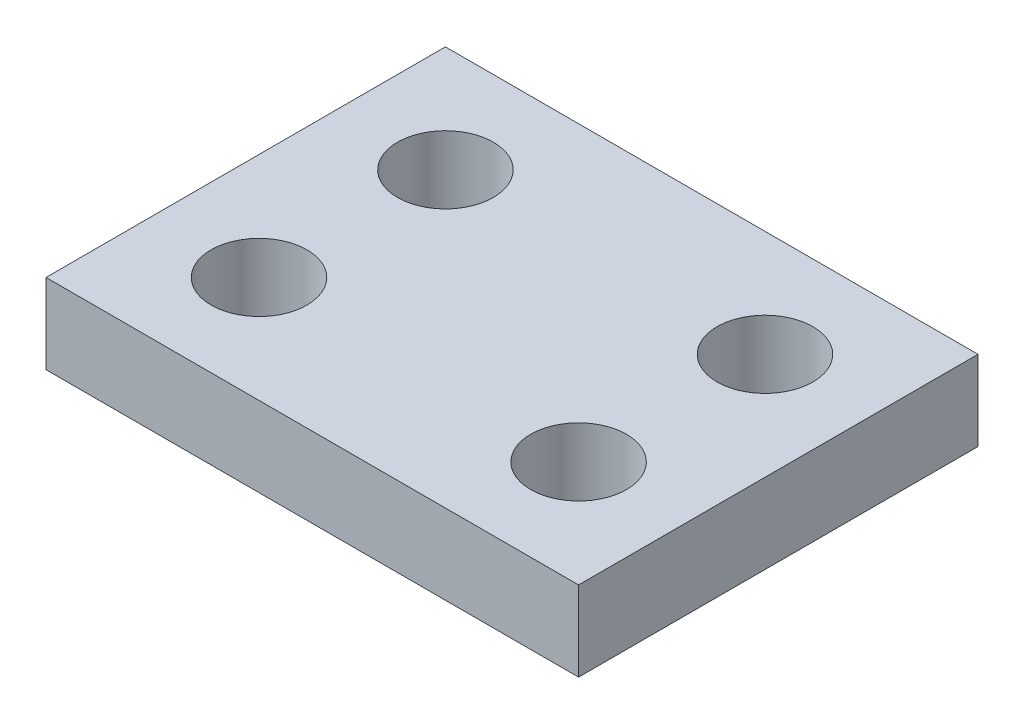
from build123d import *

# Parameters (mm, degrees)
SKETCH1_W              = 100
SKETCH1_H              = 75
BOSS_EXTRUDE1_DEPTH    = 15
M20X2_0_TAPPED_HOLE1_D = 18


with BuildPart() as part:
    # Sketch1 → Boss-Extrude1 (new body)
    with BuildSketch(Plane(origin=(0, 0, 0), x_dir=(1, 0, 0), z_dir=(0, 1, 0))):
        Rectangle(SKETCH1_W, SKETCH1_H)
    extrude(amount=BOSS_EXTRUDE1_DEPTH)

    # M20x2.0 Tapped Hole1 (through all)
    with Locations(Plane(origin=(0, 15, 0), x_dir=(-1, 0, 0), z_dir=(0, 1, 0))):
        with Locations((30, 17.5), (30, -17.5), (-30, -17.5), (-30, 17.5)):
            Hole(M20X2_0_TAPPED_HOLE1_D / 2)


solid = part.part
